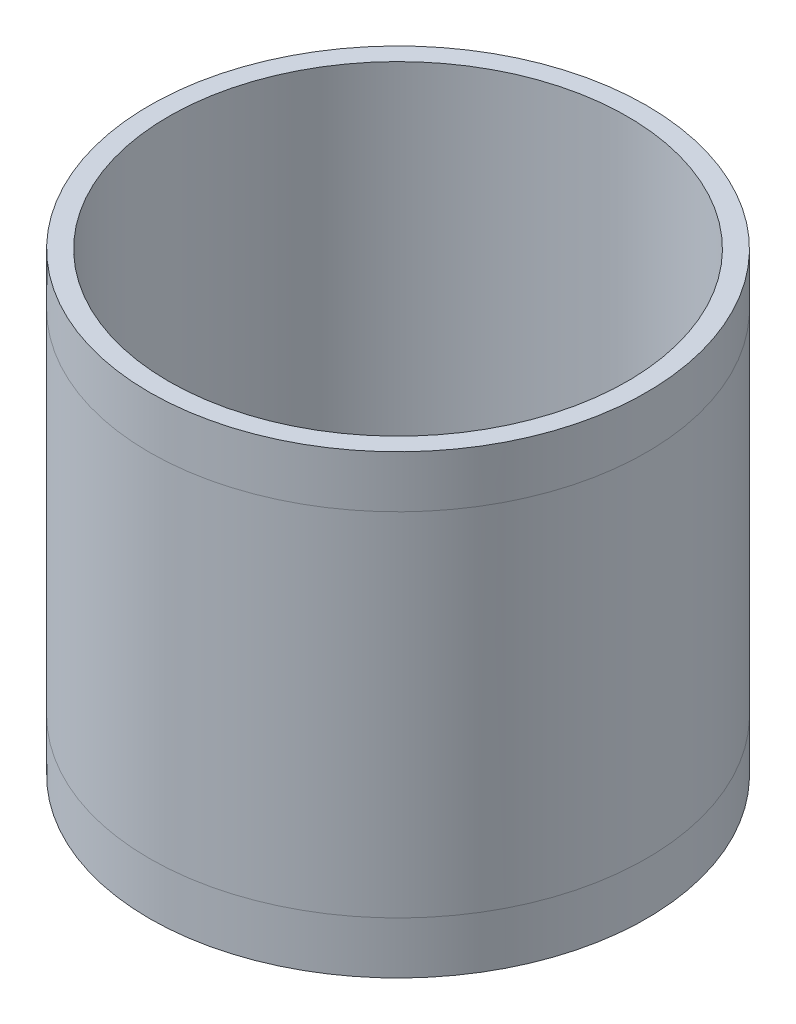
ISO-10303-21;
HEADER;
FILE_DESCRIPTION(('STEP AP214'),'2;1');
FILE_NAME('part.step','',(''),(''),'','','');
FILE_SCHEMA(('AUTOMOTIVE_DESIGN { 1 0 10303 214 1 1 1 1 }'));
ENDSEC;
DATA;
#1=APPLICATION_CONTEXT('core data for automotive mechanical design processes');
#2=APPLICATION_PROTOCOL_DEFINITION('international standard','automotive_design',2000,#1);
#3=PRODUCT_CONTEXT('',#1,'mechanical');
#4=PRODUCT('Part','Part','',(#3));
#5=PRODUCT_RELATED_PRODUCT_CATEGORY('part','',(#4));
#6=PRODUCT_DEFINITION_FORMATION('','',#4);
#7=PRODUCT_DEFINITION_CONTEXT('part definition',#1,'design');
#8=PRODUCT_DEFINITION('design','',#6,#7);
#9=PRODUCT_DEFINITION_SHAPE('','',#8);
#10=(LENGTH_UNIT() NAMED_UNIT(*) SI_UNIT(.MILLI.,.METRE.));
#11=(NAMED_UNIT(*) PLANE_ANGLE_UNIT() SI_UNIT($,.RADIAN.));
#12=(NAMED_UNIT(*) SI_UNIT($,.STERADIAN.) SOLID_ANGLE_UNIT());
#13=UNCERTAINTY_MEASURE_WITH_UNIT(LENGTH_MEASURE(1.E-05),#10,'distance_accuracy_value','');
#14=(GEOMETRIC_REPRESENTATION_CONTEXT(3) GLOBAL_UNCERTAINTY_ASSIGNED_CONTEXT((#13)) GLOBAL_UNIT_ASSIGNED_CONTEXT((#10,
#11,#12)) REPRESENTATION_CONTEXT('',''));
#15=CARTESIAN_POINT('',(0.,0.,0.));
#16=DIRECTION('',(0.,0.,1.));
#17=DIRECTION('',(1.,0.,0.));
#18=AXIS2_PLACEMENT_3D('',#15,#16,#17);
#19=CARTESIAN_POINT('',(0.,85.852,0.));
#20=DIRECTION('',(0.,1.,0.));
#21=DIRECTION('',(0.,0.,1.));
#22=AXIS2_PLACEMENT_3D('',#19,#20,#21);
#23=CYLINDRICAL_SURFACE('',#22,82.55);
#24=CARTESIAN_POINT('',(0.,58.4224,0.));
#25=DIRECTION('',(0.,1.,0.));
#26=DIRECTION('',(-1.,0.,0.));
#27=AXIS2_PLACEMENT_3D('',#24,#25,#26);
#28=CIRCLE('',#27,82.55);
#29=CARTESIAN_POINT('',(-82.55,58.4224,0.));
#30=VERTEX_POINT('',#29);
#31=EDGE_CURVE('E49',#30,#30,#28,.T.);
#32=ORIENTED_EDGE('',*,*,#31,.F.);
#33=EDGE_LOOP('',(#32));
#34=FACE_BOUND('',#33,.T.);
#35=CARTESIAN_POINT('',(0.,-58.42,0.));
#36=DIRECTION('',(0.,-1.,0.));
#37=DIRECTION('',(0.,0.,-1.));
#38=AXIS2_PLACEMENT_3D('',#35,#36,#37);
#39=CIRCLE('',#38,82.55);
#40=CARTESIAN_POINT('',(0.,-58.42,-82.55));
#41=VERTEX_POINT('',#40);
#42=EDGE_CURVE('E10',#41,#41,#39,.T.);
#43=ORIENTED_EDGE('',*,*,#42,.F.);
#44=EDGE_LOOP('',(#43));
#45=FACE_BOUND('',#44,.T.);
#46=ADVANCED_FACE('F41',(#34,#45),#23,.T.);
#47=ORIENTED_EDGE('',*,*,#42,.T.);
#48=EDGE_LOOP('',(#47));
#49=FACE_BOUND('',#48,.T.);
#50=CARTESIAN_POINT('',(0.,-75.6920000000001,0.));
#51=DIRECTION('',(0.,1.,0.));
#52=DIRECTION('',(0.,0.,1.));
#53=AXIS2_PLACEMENT_3D('',#50,#51,#52);
#54=CIRCLE('',#53,82.55);
#55=CARTESIAN_POINT('',(0.,-75.6920000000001,82.55));
#56=VERTEX_POINT('',#55);
#57=EDGE_CURVE('E56',#56,#56,#54,.T.);
#58=ORIENTED_EDGE('',*,*,#57,.T.);
#59=EDGE_LOOP('',(#58));
#60=FACE_BOUND('',#59,.T.);
#61=ADVANCED_FACE('F78',(#49,#60),#23,.T.);
#62=ORIENTED_EDGE('',*,*,#31,.T.);
#63=EDGE_LOOP('',(#62));
#64=FACE_BOUND('',#63,.T.);
#65=CARTESIAN_POINT('',(0.,75.6944000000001,0.));
#66=DIRECTION('',(0.,1.,0.));
#67=DIRECTION('',(0.,0.,1.));
#68=AXIS2_PLACEMENT_3D('',#65,#66,#67);
#69=CIRCLE('',#68,82.55);
#70=CARTESIAN_POINT('',(0.,75.6944000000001,82.55));
#71=VERTEX_POINT('',#70);
#72=EDGE_CURVE('E70',#71,#71,#69,.T.);
#73=ORIENTED_EDGE('',*,*,#72,.F.);
#74=EDGE_LOOP('',(#73));
#75=FACE_BOUND('',#74,.T.);
#76=ADVANCED_FACE('F43',(#64,#75),#23,.T.);
#77=CARTESIAN_POINT('',(82.55,-75.6920000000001,0.));
#78=DIRECTION('',(0.,1.,0.));
#79=DIRECTION('',(0.,0.,1.));
#80=AXIS2_PLACEMENT_3D('',#77,#78,#79);
#81=PLANE('',#80);
#82=ORIENTED_EDGE('',*,*,#57,.F.);
#83=EDGE_LOOP('',(#82));
#84=FACE_BOUND('',#83,.T.);
#85=CARTESIAN_POINT('',(0.,-75.6920000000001,0.));
#86=DIRECTION('',(0.,1.,0.));
#87=DIRECTION('',(0.,0.,1.));
#88=AXIS2_PLACEMENT_3D('',#85,#86,#87);
#89=CIRCLE('',#88,76.2);
#90=CARTESIAN_POINT('',(0.,-75.6920000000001,76.2));
#91=VERTEX_POINT('',#90);
#92=EDGE_CURVE('E62',#91,#91,#89,.T.);
#93=ORIENTED_EDGE('',*,*,#92,.T.);
#94=EDGE_LOOP('',(#93));
#95=FACE_BOUND('',#94,.T.);
#96=ADVANCED_FACE('F77',(#84,#95),#81,.F.);
#97=CARTESIAN_POINT('',(0.,85.852,0.));
#98=DIRECTION('',(0.,1.,0.));
#99=DIRECTION('',(0.,0.,1.));
#100=AXIS2_PLACEMENT_3D('',#97,#98,#99);
#101=CYLINDRICAL_SURFACE('',#100,76.2);
#102=ORIENTED_EDGE('',*,*,#92,.F.);
#103=EDGE_LOOP('',(#102));
#104=FACE_BOUND('',#103,.T.);
#105=CARTESIAN_POINT('',(0.,75.6944000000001,0.));
#106=DIRECTION('',(0.,1.,0.));
#107=DIRECTION('',(0.,0.,1.));
#108=AXIS2_PLACEMENT_3D('',#105,#106,#107);
#109=CIRCLE('',#108,76.2);
#110=CARTESIAN_POINT('',(0.,75.6944000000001,76.2));
#111=VERTEX_POINT('',#110);
#112=EDGE_CURVE('E67',#111,#111,#109,.T.);
#113=ORIENTED_EDGE('',*,*,#112,.T.);
#114=EDGE_LOOP('',(#113));
#115=FACE_BOUND('',#114,.T.);
#116=ADVANCED_FACE('F83',(#104,#115),#101,.F.);
#117=CARTESIAN_POINT('',(76.2,75.6944000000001,0.));
#118=DIRECTION('',(0.,-1.,0.));
#119=DIRECTION('',(0.,0.,-1.));
#120=AXIS2_PLACEMENT_3D('',#117,#118,#119);
#121=PLANE('',#120);
#122=ORIENTED_EDGE('',*,*,#112,.F.);
#123=EDGE_LOOP('',(#122));
#124=FACE_BOUND('',#123,.T.);
#125=ORIENTED_EDGE('',*,*,#72,.T.);
#126=EDGE_LOOP('',(#125));
#127=FACE_BOUND('',#126,.T.);
#128=ADVANCED_FACE('F74',(#124,#127),#121,.F.);
#129=CLOSED_SHELL('',(#46,#61,#76,#96,#116,#128));
#130=MANIFOLD_SOLID_BREP('B2',#129);
#131=ADVANCED_BREP_SHAPE_REPRESENTATION('',(#18,#130),#14);
#132=SHAPE_DEFINITION_REPRESENTATION(#9,#131);
ENDSEC;
END-ISO-10303-21;
